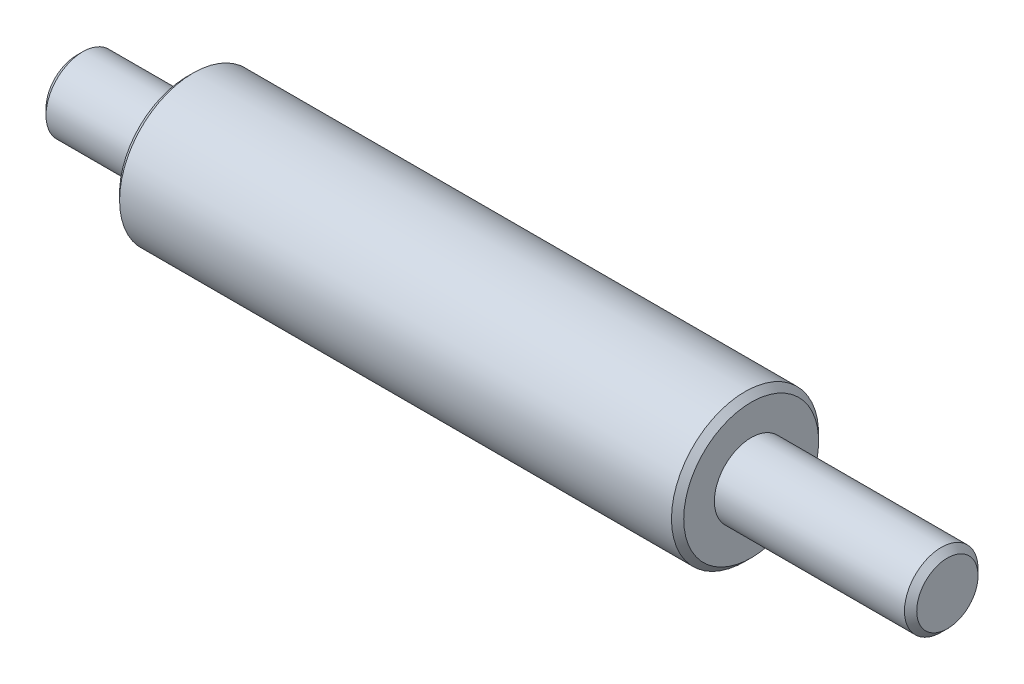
ISO-10303-21;
HEADER;
FILE_DESCRIPTION(('STEP AP214'),'2;1');
FILE_NAME('part.step','',(''),(''),'','','');
FILE_SCHEMA(('AUTOMOTIVE_DESIGN { 1 0 10303 214 1 1 1 1 }'));
ENDSEC;
DATA;
#1=APPLICATION_CONTEXT('core data for automotive mechanical design processes');
#2=APPLICATION_PROTOCOL_DEFINITION('international standard','automotive_design',2000,#1);
#3=PRODUCT_CONTEXT('',#1,'mechanical');
#4=PRODUCT('Part','Part','',(#3));
#5=PRODUCT_RELATED_PRODUCT_CATEGORY('part','',(#4));
#6=PRODUCT_DEFINITION_FORMATION('','',#4);
#7=PRODUCT_DEFINITION_CONTEXT('part definition',#1,'design');
#8=PRODUCT_DEFINITION('design','',#6,#7);
#9=PRODUCT_DEFINITION_SHAPE('','',#8);
#10=(LENGTH_UNIT() NAMED_UNIT(*) SI_UNIT(.MILLI.,.METRE.));
#11=(NAMED_UNIT(*) PLANE_ANGLE_UNIT() SI_UNIT($,.RADIAN.));
#12=(NAMED_UNIT(*) SI_UNIT($,.STERADIAN.) SOLID_ANGLE_UNIT());
#13=UNCERTAINTY_MEASURE_WITH_UNIT(LENGTH_MEASURE(1.E-05),#10,'distance_accuracy_value','');
#14=(GEOMETRIC_REPRESENTATION_CONTEXT(3) GLOBAL_UNCERTAINTY_ASSIGNED_CONTEXT((#13)) GLOBAL_UNIT_ASSIGNED_CONTEXT((#10,
#11,#12)) REPRESENTATION_CONTEXT('',''));
#15=CARTESIAN_POINT('',(0.,0.,0.));
#16=DIRECTION('',(0.,0.,1.));
#17=DIRECTION('',(1.,0.,0.));
#18=AXIS2_PLACEMENT_3D('',#15,#16,#17);
#19=CARTESIAN_POINT('',(0.,3.,0.));
#20=DIRECTION('',(1.,0.,0.));
#21=DIRECTION('',(0.,0.,-1.));
#22=AXIS2_PLACEMENT_3D('',#19,#20,#21);
#23=PLANE('',#22);
#24=CARTESIAN_POINT('',(0.,0.,0.));
#25=DIRECTION('',(1.,0.,0.));
#26=DIRECTION('',(0.,0.,-1.));
#27=AXIS2_PLACEMENT_3D('',#24,#25,#26);
#28=CIRCLE('',#27,2.75);
#29=CARTESIAN_POINT('',(0.,0.,-2.75));
#30=VERTEX_POINT('',#29);
#31=EDGE_CURVE('E25',#30,#30,#28,.F.);
#32=ORIENTED_EDGE('',*,*,#31,.T.);
#33=EDGE_LOOP('',(#32));
#34=FACE_BOUND('',#33,.T.);
#35=CARTESIAN_POINT('',(0.,0.,0.));
#36=DIRECTION('',(-1.,0.,0.));
#37=DIRECTION('',(0.,0.,1.));
#38=AXIS2_PLACEMENT_3D('',#35,#36,#37);
#39=CIRCLE('',#38,1.5);
#40=CARTESIAN_POINT('',(0.,0.,1.5));
#41=VERTEX_POINT('',#40);
#42=EDGE_CURVE('E49',#41,#41,#39,.T.);
#43=ORIENTED_EDGE('',*,*,#42,.F.);
#44=EDGE_LOOP('',(#43));
#45=FACE_BOUND('',#44,.T.);
#46=ADVANCED_FACE('F15',(#34,#45),#23,.F.);
#47=CARTESIAN_POINT('',(-121.991549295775,0.,0.));
#48=DIRECTION('',(-1.,0.,0.));
#49=DIRECTION('',(0.,0.,1.));
#50=AXIS2_PLACEMENT_3D('',#47,#48,#49);
#51=CYLINDRICAL_SURFACE('',#50,3.);
#52=CARTESIAN_POINT('',(22.75,0.,0.));
#53=DIRECTION('',(-1.,0.,0.));
#54=DIRECTION('',(0.,0.,1.));
#55=AXIS2_PLACEMENT_3D('',#52,#53,#54);
#56=CIRCLE('',#55,3.);
#57=CARTESIAN_POINT('',(22.75,0.,3.));
#58=VERTEX_POINT('',#57);
#59=EDGE_CURVE('E34',#58,#58,#56,.T.);
#60=ORIENTED_EDGE('',*,*,#59,.T.);
#61=EDGE_LOOP('',(#60));
#62=FACE_BOUND('',#61,.T.);
#63=CARTESIAN_POINT('',(0.25,0.,0.));
#64=DIRECTION('',(1.,0.,0.));
#65=DIRECTION('',(0.,0.,-1.));
#66=AXIS2_PLACEMENT_3D('',#63,#64,#65);
#67=CIRCLE('',#66,3.);
#68=CARTESIAN_POINT('',(0.25,0.,-3.));
#69=VERTEX_POINT('',#68);
#70=EDGE_CURVE('E37',#69,#69,#67,.T.);
#71=ORIENTED_EDGE('',*,*,#70,.T.);
#72=EDGE_LOOP('',(#71));
#73=FACE_BOUND('',#72,.T.);
#74=ADVANCED_FACE('F56',(#62,#73),#51,.T.);
#75=CARTESIAN_POINT('',(23.,3.,0.));
#76=DIRECTION('',(-1.,0.,0.));
#77=DIRECTION('',(0.,0.,1.));
#78=AXIS2_PLACEMENT_3D('',#75,#76,#77);
#79=PLANE('',#78);
#80=CARTESIAN_POINT('',(23.,0.,0.));
#81=DIRECTION('',(-1.,0.,0.));
#82=DIRECTION('',(0.,0.,1.));
#83=AXIS2_PLACEMENT_3D('',#80,#81,#82);
#84=CIRCLE('',#83,2.75);
#85=CARTESIAN_POINT('',(23.,0.,2.75));
#86=VERTEX_POINT('',#85);
#87=EDGE_CURVE('E29',#86,#86,#84,.F.);
#88=ORIENTED_EDGE('',*,*,#87,.T.);
#89=EDGE_LOOP('',(#88));
#90=FACE_BOUND('',#89,.T.);
#91=CARTESIAN_POINT('',(23.,0.,0.));
#92=DIRECTION('',(-1.,0.,0.));
#93=DIRECTION('',(0.,0.,1.));
#94=AXIS2_PLACEMENT_3D('',#91,#92,#93);
#95=CIRCLE('',#94,1.5);
#96=CARTESIAN_POINT('',(23.,0.,1.5));
#97=VERTEX_POINT('',#96);
#98=EDGE_CURVE('E46',#97,#97,#95,.T.);
#99=ORIENTED_EDGE('',*,*,#98,.T.);
#100=EDGE_LOOP('',(#99));
#101=FACE_BOUND('',#100,.T.);
#102=ADVANCED_FACE('F62',(#90,#101),#79,.F.);
#103=CARTESIAN_POINT('',(-121.991549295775,0.,0.));
#104=DIRECTION('',(-1.,0.,0.));
#105=DIRECTION('',(0.,0.,1.));
#106=AXIS2_PLACEMENT_3D('',#103,#104,#105);
#107=CYLINDRICAL_SURFACE('',#106,1.5);
#108=CARTESIAN_POINT('',(30.75,0.,0.));
#109=DIRECTION('',(-1.,0.,0.));
#110=DIRECTION('',(0.,0.,1.));
#111=AXIS2_PLACEMENT_3D('',#108,#109,#110);
#112=CIRCLE('',#111,1.5);
#113=CARTESIAN_POINT('',(30.75,0.,1.5));
#114=VERTEX_POINT('',#113);
#115=EDGE_CURVE('E43',#114,#114,#112,.T.);
#116=ORIENTED_EDGE('',*,*,#115,.T.);
#117=EDGE_LOOP('',(#116));
#118=FACE_BOUND('',#117,.T.);
#119=ORIENTED_EDGE('',*,*,#98,.F.);
#120=EDGE_LOOP('',(#119));
#121=FACE_BOUND('',#120,.T.);
#122=ADVANCED_FACE('F94',(#118,#121),#107,.T.);
#123=CARTESIAN_POINT('',(31.,1.5,0.));
#124=DIRECTION('',(-1.,0.,0.));
#125=DIRECTION('',(0.,0.,1.));
#126=AXIS2_PLACEMENT_3D('',#123,#124,#125);
#127=PLANE('',#126);
#128=CARTESIAN_POINT('',(31.,0.,0.));
#129=DIRECTION('',(-1.,0.,0.));
#130=DIRECTION('',(0.,0.,1.));
#131=AXIS2_PLACEMENT_3D('',#128,#129,#130);
#132=CIRCLE('',#131,1.24999999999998);
#133=CARTESIAN_POINT('',(31.,0.,1.24999999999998));
#134=VERTEX_POINT('',#133);
#135=EDGE_CURVE('E40',#134,#134,#132,.F.);
#136=ORIENTED_EDGE('',*,*,#135,.T.);
#137=EDGE_LOOP('',(#136));
#138=FACE_BOUND('',#137,.T.);
#139=ADVANCED_FACE('F91',(#138),#127,.F.);
#140=CARTESIAN_POINT('',(-4.5,1.5,0.));
#141=DIRECTION('',(1.,0.,0.));
#142=DIRECTION('',(0.,0.,-1.));
#143=AXIS2_PLACEMENT_3D('',#140,#141,#142);
#144=PLANE('',#143);
#145=CARTESIAN_POINT('',(-4.5,0.,0.));
#146=DIRECTION('',(1.,0.,0.));
#147=DIRECTION('',(0.,0.,-1.));
#148=AXIS2_PLACEMENT_3D('',#145,#146,#147);
#149=CIRCLE('',#148,1.25);
#150=CARTESIAN_POINT('',(-4.5,0.,-1.25));
#151=VERTEX_POINT('',#150);
#152=EDGE_CURVE('E21',#151,#151,#149,.F.);
#153=ORIENTED_EDGE('',*,*,#152,.T.);
#154=EDGE_LOOP('',(#153));
#155=FACE_BOUND('',#154,.T.);
#156=ADVANCED_FACE('F88',(#155),#144,.F.);
#157=CARTESIAN_POINT('',(-121.991549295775,0.,0.));
#158=DIRECTION('',(-1.,0.,0.));
#159=DIRECTION('',(0.,0.,1.));
#160=AXIS2_PLACEMENT_3D('',#157,#158,#159);
#161=CYLINDRICAL_SURFACE('',#160,1.5);
#162=CARTESIAN_POINT('',(-4.25,0.,0.));
#163=DIRECTION('',(1.,0.,0.));
#164=DIRECTION('',(0.,0.,-1.));
#165=AXIS2_PLACEMENT_3D('',#162,#163,#164);
#166=CIRCLE('',#165,1.5);
#167=CARTESIAN_POINT('',(-4.25,0.,-1.5));
#168=VERTEX_POINT('',#167);
#169=EDGE_CURVE('E10',#168,#168,#166,.T.);
#170=ORIENTED_EDGE('',*,*,#169,.T.);
#171=EDGE_LOOP('',(#170));
#172=FACE_BOUND('',#171,.T.);
#173=ORIENTED_EDGE('',*,*,#42,.T.);
#174=EDGE_LOOP('',(#173));
#175=FACE_BOUND('',#174,.T.);
#176=ADVANCED_FACE('F53',(#172,#175),#161,.T.);
#177=CARTESIAN_POINT('',(30.75,0.,0.));
#178=DIRECTION('',(-1.,0.,0.));
#179=DIRECTION('',(0.,0.,1.));
#180=AXIS2_PLACEMENT_3D('',#177,#178,#179);
#181=CONICAL_SURFACE('',#180,1.5,0.78539816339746);
#182=ORIENTED_EDGE('',*,*,#135,.F.);
#183=EDGE_LOOP('',(#182));
#184=FACE_BOUND('',#183,.T.);
#185=ORIENTED_EDGE('',*,*,#115,.F.);
#186=EDGE_LOOP('',(#185));
#187=FACE_BOUND('',#186,.T.);
#188=ADVANCED_FACE('F78',(#184,#187),#181,.T.);
#189=CARTESIAN_POINT('',(22.75,0.,0.));
#190=DIRECTION('',(-1.,0.,0.));
#191=DIRECTION('',(0.,0.,1.));
#192=AXIS2_PLACEMENT_3D('',#189,#190,#191);
#193=CONICAL_SURFACE('',#192,3.,0.785398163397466);
#194=ORIENTED_EDGE('',*,*,#87,.F.);
#195=EDGE_LOOP('',(#194));
#196=FACE_BOUND('',#195,.T.);
#197=ORIENTED_EDGE('',*,*,#59,.F.);
#198=EDGE_LOOP('',(#197));
#199=FACE_BOUND('',#198,.T.);
#200=ADVANCED_FACE('F69',(#196,#199),#193,.T.);
#201=CARTESIAN_POINT('',(0.,0.,0.));
#202=DIRECTION('',(1.,0.,0.));
#203=DIRECTION('',(0.,0.,-1.));
#204=AXIS2_PLACEMENT_3D('',#201,#202,#203);
#205=CONICAL_SURFACE('',#204,2.75,0.785398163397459);
#206=ORIENTED_EDGE('',*,*,#70,.F.);
#207=EDGE_LOOP('',(#206));
#208=FACE_BOUND('',#207,.T.);
#209=ORIENTED_EDGE('',*,*,#31,.F.);
#210=EDGE_LOOP('',(#209));
#211=FACE_BOUND('',#210,.T.);
#212=ADVANCED_FACE('F66',(#208,#211),#205,.T.);
#213=CARTESIAN_POINT('',(-4.5,0.,0.));
#214=DIRECTION('',(1.,0.,0.));
#215=DIRECTION('',(0.,0.,-1.));
#216=AXIS2_PLACEMENT_3D('',#213,#214,#215);
#217=CONICAL_SURFACE('',#216,1.25,0.785398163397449);
#218=ORIENTED_EDGE('',*,*,#169,.F.);
#219=EDGE_LOOP('',(#218));
#220=FACE_BOUND('',#219,.T.);
#221=ORIENTED_EDGE('',*,*,#152,.F.);
#222=EDGE_LOOP('',(#221));
#223=FACE_BOUND('',#222,.T.);
#224=ADVANCED_FACE('F68',(#220,#223),#217,.T.);
#225=CLOSED_SHELL('',(#46,#74,#102,#122,#139,#156,#176,#188,#200,#212,#224));
#226=MANIFOLD_SOLID_BREP('B1',#225);
#227=ADVANCED_BREP_SHAPE_REPRESENTATION('',(#18,#226),#14);
#228=SHAPE_DEFINITION_REPRESENTATION(#9,#227);
ENDSEC;
END-ISO-10303-21;
